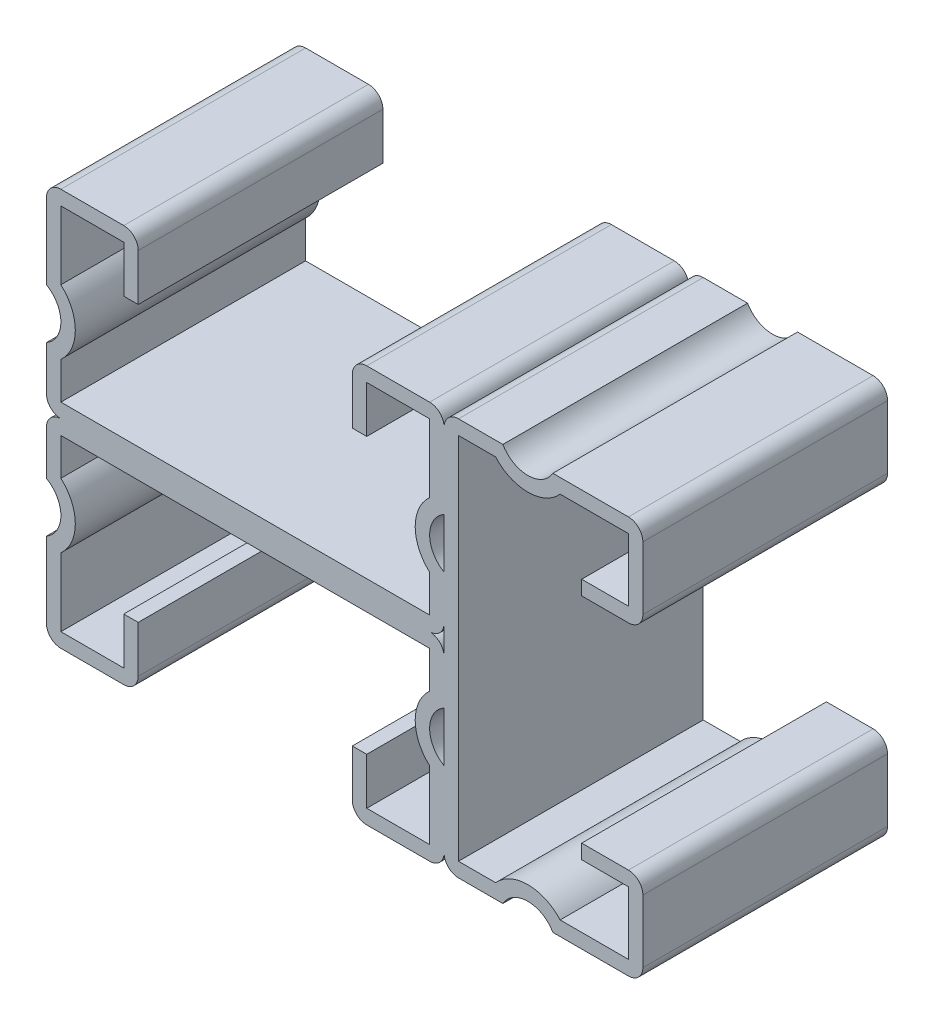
from build123d import *

# Parameters (mm, degrees)
BASE_EXTRUDE_DEPTH  = 12.7
BOSS_EXTRUDE1_DEPTH = 12.7


with BuildPart() as part:
    # Sketch1 → Base-Extrude (new, symmetric)
    with BuildSketch(Plane.XY):
        with BuildLine():
            Line((-20.6375, 19.1389), (-20.6375, 11.29515134))
            ThreePointArc((-20.6375, 11.29515134), (-19.1389, 8.6995), (-20.6375, 6.10384866))
            Line((-20.6375, 6.10384866), (-20.6375, 1.4986))
            ThreePointArc((-20.6375, 1.4986), (-20.198570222, 0.438929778), (-19.1389, 0))
            Line((-19.1389, 0), (19.1389, 0))
            ThreePointArc((19.1389, 0), (20.198570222, 0.438929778), (20.6375, 1.4986))
            Line((20.6375, 1.4986), (20.6375, 6.10384866))
            ThreePointArc((20.6375, 6.10384866), (19.1389, 8.6995), (20.6375, 11.29515134))
            Line((20.6375, 11.29515134), (20.6375, 19.1389))
            ThreePointArc((20.6375, 19.1389), (20.198570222, 20.198570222), (19.1389, 20.6375))
            Line((19.1389, 20.6375), (12.6111, 20.6375))
            ThreePointArc((12.6111, 20.6375), (11.551429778, 20.198570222), (11.1125, 19.1389))
            Line((11.1125, 19.1389), (11.1125, 14.2875))
            Line((11.1125, 14.2875), (12.6111, 14.2875))
            Line((12.6111, 14.2875), (12.6111, 19.1389))
            Line((12.6111, 19.1389), (19.1389, 19.1389))
            Line((19.1389, 19.1389), (19.1389, 12.050471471))
            ThreePointArc((19.1389, 12.050471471), (17.6403, 8.6995), (19.1389, 5.348528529))
            Line((19.1389, 5.348528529), (19.1389, 1.4986))
            Line((19.1389, 1.4986), (-19.1389, 1.4986))
            Line((-19.1389, 1.4986), (-19.1389, 5.348528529))
            ThreePointArc((-19.1389, 5.348528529), (-17.6403, 8.6995), (-19.1389, 12.050471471))
            Line((-19.1389, 12.050471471), (-19.1389, 19.1389))
            Line((-19.1389, 19.1389), (-12.6111, 19.1389))
            Line((-12.6111, 19.1389), (-12.6111, 14.2875))
            Line((-12.6111, 14.2875), (-11.1125, 14.2875))
            Line((-11.1125, 14.2875), (-11.1125, 19.1389))
            ThreePointArc((-11.1125, 19.1389), (-11.551429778, 20.198570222), (-12.6111, 20.6375))
            Line((-12.6111, 20.6375), (-19.1389, 20.6375))
            ThreePointArc((-19.1389, 20.6375), (-20.198570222, 20.198570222), (-20.6375, 19.1389))
        make_face()
    base_extrude = extrude(amount=BASE_EXTRUDE_DEPTH, both=True)

    # Mirror1: Base-Extrude across plane
    add(base_extrude.mirror(Plane.ZX))

    # Sketch2 → Boss-Extrude1 (add, symmetric)
    with BuildSketch(Plane(origin=(20.16125, 0.15875, 0), x_dir=(0, -1, 0), z_dir=(0, 0, 1))):
        with BuildLine():
            Line((-20.47875, 19.61515), (-20.47875, 11.77140134))
            ThreePointArc((-20.47875, 11.77140134), (-18.98015, 9.17575), (-20.47875, 6.58009866))
            Line((-20.47875, 6.58009866), (-20.47875, 1.97485))
            ThreePointArc((-20.47875, 1.97485), (-20.039820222, 0.915179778), (-18.98015, 0.47625))
            Line((-18.98015, 0.47625), (19.29765, 0.47625))
            ThreePointArc((19.29765, 0.47625), (20.357320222, 0.915179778), (20.79625, 1.97485))
            Line((20.79625, 1.97485), (20.79625, 6.58009866))
            ThreePointArc((20.79625, 6.58009866), (19.29765, 9.17575), (20.79625, 11.77140134))
            Line((20.79625, 11.77140134), (20.79625, 19.61515))
            ThreePointArc((20.79625, 19.61515), (20.357320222, 20.674820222), (19.29765, 21.11375))
            Line((19.29765, 21.11375), (12.76985, 21.11375))
            ThreePointArc((12.76985, 21.11375), (11.710179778, 20.674820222), (11.27125, 19.61515))
            Line((11.27125, 19.61515), (11.27125, 14.76375))
            Line((11.27125, 14.76375), (12.76985, 14.76375))
            Line((12.76985, 14.76375), (12.76985, 19.61515))
            Line((12.76985, 19.61515), (19.29765, 19.61515))
            Line((19.29765, 19.61515), (19.29765, 12.526721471))
            ThreePointArc((19.29765, 12.526721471), (17.79905, 9.17575), (19.29765, 5.824778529))
            Line((19.29765, 5.824778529), (19.29765, 1.97485))
            Line((19.29765, 1.97485), (-18.98015, 1.97485))
            Line((-18.98015, 1.97485), (-18.98015, 5.824778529))
            ThreePointArc((-18.98015, 5.824778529), (-17.48155, 9.17575), (-18.98015, 12.526721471))
            Line((-18.98015, 12.526721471), (-18.98015, 19.61515))
            Line((-18.98015, 19.61515), (-12.45235, 19.61515))
            Line((-12.45235, 19.61515), (-12.45235, 14.76375))
            Line((-12.45235, 14.76375), (-10.95375, 14.76375))
            Line((-10.95375, 14.76375), (-10.95375, 19.61515))
            ThreePointArc((-10.95375, 19.61515), (-11.392679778, 20.674820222), (-12.45235, 21.11375))
            Line((-12.45235, 21.11375), (-18.98015, 21.11375))
            ThreePointArc((-18.98015, 21.11375), (-20.039820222, 20.674820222), (-20.47875, 19.61515))
        make_face()
    extrude(amount=BOSS_EXTRUDE1_DEPTH, both=True)


solid = part.part
